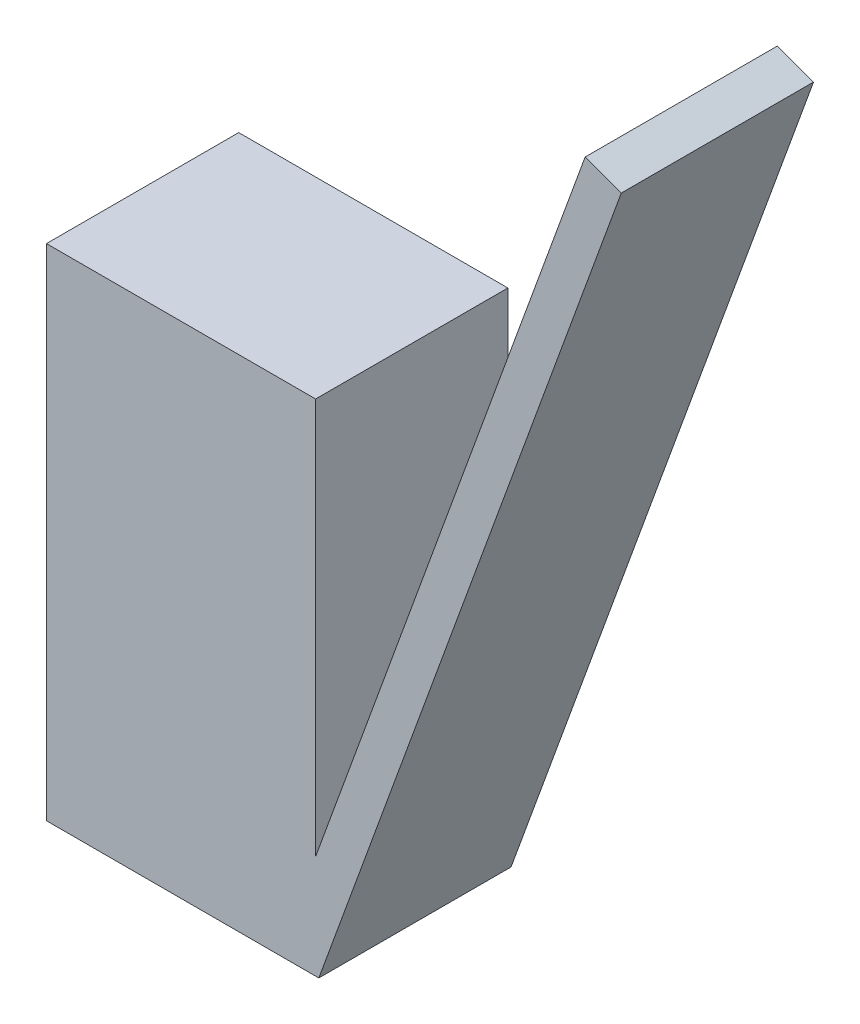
ISO-10303-21;
HEADER;
FILE_DESCRIPTION(('STEP AP214'),'2;1');
FILE_NAME('part.step','',(''),(''),'','','');
FILE_SCHEMA(('AUTOMOTIVE_DESIGN { 1 0 10303 214 1 1 1 1 }'));
ENDSEC;
DATA;
#1=APPLICATION_CONTEXT('core data for automotive mechanical design processes');
#2=APPLICATION_PROTOCOL_DEFINITION('international standard','automotive_design',2000,#1);
#3=PRODUCT_CONTEXT('',#1,'mechanical');
#4=PRODUCT('Part','Part','',(#3));
#5=PRODUCT_RELATED_PRODUCT_CATEGORY('part','',(#4));
#6=PRODUCT_DEFINITION_FORMATION('','',#4);
#7=PRODUCT_DEFINITION_CONTEXT('part definition',#1,'design');
#8=PRODUCT_DEFINITION('design','',#6,#7);
#9=PRODUCT_DEFINITION_SHAPE('','',#8);
#10=(LENGTH_UNIT() NAMED_UNIT(*) SI_UNIT(.MILLI.,.METRE.));
#11=(NAMED_UNIT(*) PLANE_ANGLE_UNIT() SI_UNIT($,.RADIAN.));
#12=(NAMED_UNIT(*) SI_UNIT($,.STERADIAN.) SOLID_ANGLE_UNIT());
#13=UNCERTAINTY_MEASURE_WITH_UNIT(LENGTH_MEASURE(1.E-05),#10,'distance_accuracy_value','');
#14=(GEOMETRIC_REPRESENTATION_CONTEXT(3) GLOBAL_UNCERTAINTY_ASSIGNED_CONTEXT((#13)) GLOBAL_UNIT_ASSIGNED_CONTEXT((#10,
#11,#12)) REPRESENTATION_CONTEXT('',''));
#15=CARTESIAN_POINT('',(0.,0.,0.));
#16=DIRECTION('',(0.,0.,1.));
#17=DIRECTION('',(1.,0.,0.));
#18=AXIS2_PLACEMENT_3D('',#15,#16,#17);
#19=CARTESIAN_POINT('',(-7.0829769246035,13.,5.));
#20=DIRECTION('',(1.,0.,0.));
#21=DIRECTION('',(0.,1.,0.));
#22=AXIS2_PLACEMENT_3D('',#19,#20,#21);
#23=PLANE('',#22);
#24=DIRECTION('',(0.,-1.,0.));
#25=VECTOR('',#24,1.);
#26=CARTESIAN_POINT('',(-7.0829769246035,13.,0.));
#27=LINE('',#26,#25);
#28=CARTESIAN_POINT('',(-7.0829769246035,13.,0.));
#29=VERTEX_POINT('',#28);
#30=CARTESIAN_POINT('',(-7.0829769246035,0.,0.));
#31=VERTEX_POINT('',#30);
#32=EDGE_CURVE('E410',#29,#31,#27,.T.);
#33=ORIENTED_EDGE('',*,*,#32,.T.);
#34=DIRECTION('',(0.,0.,-1.));
#35=VECTOR('',#34,1.);
#36=CARTESIAN_POINT('',(-7.0829769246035,0.,5.));
#37=LINE('',#36,#35);
#38=CARTESIAN_POINT('',(-7.0829769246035,0.,5.));
#39=VERTEX_POINT('',#38);
#40=EDGE_CURVE('E11',#39,#31,#37,.T.);
#41=ORIENTED_EDGE('',*,*,#40,.F.);
#42=DIRECTION('',(0.,-1.,0.));
#43=VECTOR('',#42,1.);
#44=CARTESIAN_POINT('',(-7.0829769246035,13.,5.));
#45=LINE('',#44,#43);
#46=CARTESIAN_POINT('',(-7.0829769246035,13.,5.));
#47=VERTEX_POINT('',#46);
#48=EDGE_CURVE('E435',#47,#39,#45,.T.);
#49=ORIENTED_EDGE('',*,*,#48,.F.);
#50=DIRECTION('',(0.,0.,-1.));
#51=VECTOR('',#50,1.);
#52=CARTESIAN_POINT('',(-7.0829769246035,13.,5.));
#53=LINE('',#52,#51);
#54=EDGE_CURVE('E423',#47,#29,#53,.T.);
#55=ORIENTED_EDGE('',*,*,#54,.T.);
#56=EDGE_LOOP('',(#33,#41,#49,#55));
#57=FACE_BOUND('',#56,.T.);
#58=ADVANCED_FACE('F348',(#57),#23,.F.);
#59=CARTESIAN_POINT('',(-7.0829769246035,0.,5.));
#60=DIRECTION('',(0.,1.,0.));
#61=DIRECTION('',(-1.,0.,0.));
#62=AXIS2_PLACEMENT_3D('',#59,#60,#61);
#63=PLANE('',#62);
#64=DIRECTION('',(1.,0.,0.));
#65=VECTOR('',#64,1.);
#66=CARTESIAN_POINT('',(-7.0829769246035,0.,0.));
#67=LINE('',#66,#65);
#68=CARTESIAN_POINT('',(0.,0.,0.));
#69=VERTEX_POINT('',#68);
#70=EDGE_CURVE('E406',#31,#69,#67,.T.);
#71=ORIENTED_EDGE('',*,*,#70,.T.);
#72=DIRECTION('',(0.,0.,-1.));
#73=VECTOR('',#72,1.);
#74=CARTESIAN_POINT('',(0.,0.,5.));
#75=LINE('',#74,#73);
#76=CARTESIAN_POINT('',(0.,0.,5.));
#77=VERTEX_POINT('',#76);
#78=EDGE_CURVE('E355',#77,#69,#75,.T.);
#79=ORIENTED_EDGE('',*,*,#78,.F.);
#80=DIRECTION('',(1.,0.,0.));
#81=VECTOR('',#80,1.);
#82=CARTESIAN_POINT('',(-7.0829769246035,0.,5.));
#83=LINE('',#82,#81);
#84=EDGE_CURVE('E419',#39,#77,#83,.T.);
#85=ORIENTED_EDGE('',*,*,#84,.F.);
#86=ORIENTED_EDGE('',*,*,#40,.T.);
#87=EDGE_LOOP('',(#71,#79,#85,#86));
#88=FACE_BOUND('',#87,.T.);
#89=ADVANCED_FACE('F418',(#88),#63,.F.);
#90=CARTESIAN_POINT('',(0.,0.,5.));
#91=DIRECTION('',(-0.939692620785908,0.342020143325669,0.));
#92=DIRECTION('',(-0.342020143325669,-0.939692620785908,0.));
#93=AXIS2_PLACEMENT_3D('',#90,#91,#92);
#94=PLANE('',#93);
#95=DIRECTION('',(0.342020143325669,0.939692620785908,0.));
#96=VECTOR('',#95,1.);
#97=CARTESIAN_POINT('',(0.,0.,0.));
#98=LINE('',#97,#96);
#99=CARTESIAN_POINT('',(7.86646329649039,21.6129302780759,0.));
#100=VERTEX_POINT('',#99);
#101=EDGE_CURVE('E412',#69,#100,#98,.T.);
#102=ORIENTED_EDGE('',*,*,#101,.T.);
#103=DIRECTION('',(0.,0.,-1.));
#104=VECTOR('',#103,1.);
#105=CARTESIAN_POINT('',(7.86646329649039,21.6129302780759,5.));
#106=LINE('',#105,#104);
#107=CARTESIAN_POINT('',(7.86646329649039,21.6129302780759,5.));
#108=VERTEX_POINT('',#107);
#109=EDGE_CURVE('E456',#108,#100,#106,.T.);
#110=ORIENTED_EDGE('',*,*,#109,.F.);
#111=DIRECTION('',(0.342020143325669,0.939692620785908,0.));
#112=VECTOR('',#111,1.);
#113=CARTESIAN_POINT('',(0.,0.,5.));
#114=LINE('',#113,#112);
#115=EDGE_CURVE('E438',#77,#108,#114,.T.);
#116=ORIENTED_EDGE('',*,*,#115,.F.);
#117=ORIENTED_EDGE('',*,*,#78,.T.);
#118=EDGE_LOOP('',(#102,#110,#116,#117));
#119=FACE_BOUND('',#118,.T.);
#120=ADVANCED_FACE('F460',(#119),#94,.F.);
#121=CARTESIAN_POINT('',(7.86646329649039,21.6129302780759,5.));
#122=DIRECTION('',(-0.342020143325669,-0.939692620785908,0.));
#123=DIRECTION('',(0.939692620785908,-0.342020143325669,0.));
#124=AXIS2_PLACEMENT_3D('',#121,#122,#123);
#125=PLANE('',#124);
#126=DIRECTION('',(-0.939692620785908,0.342020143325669,0.));
#127=VECTOR('',#126,1.);
#128=CARTESIAN_POINT('',(7.86646329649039,21.6129302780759,0.));
#129=LINE('',#128,#127);
#130=CARTESIAN_POINT('',(6.92677067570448,21.9549504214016,0.));
#131=VERTEX_POINT('',#130);
#132=EDGE_CURVE('E427',#100,#131,#129,.T.);
#133=ORIENTED_EDGE('',*,*,#132,.T.);
#134=DIRECTION('',(0.,0.,-1.));
#135=VECTOR('',#134,1.);
#136=CARTESIAN_POINT('',(6.92677067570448,21.9549504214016,5.));
#137=LINE('',#136,#135);
#138=CARTESIAN_POINT('',(6.92677067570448,21.9549504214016,5.));
#139=VERTEX_POINT('',#138);
#140=EDGE_CURVE('E453',#139,#131,#137,.T.);
#141=ORIENTED_EDGE('',*,*,#140,.F.);
#142=DIRECTION('',(-0.939692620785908,0.342020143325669,0.));
#143=VECTOR('',#142,1.);
#144=CARTESIAN_POINT('',(7.86646329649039,21.6129302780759,5.));
#145=LINE('',#144,#143);
#146=EDGE_CURVE('E440',#108,#139,#145,.T.);
#147=ORIENTED_EDGE('',*,*,#146,.F.);
#148=ORIENTED_EDGE('',*,*,#109,.T.);
#149=EDGE_LOOP('',(#133,#141,#147,#148));
#150=FACE_BOUND('',#149,.T.);
#151=ADVANCED_FACE('F468',(#150),#125,.F.);
#152=CARTESIAN_POINT('',(6.92677067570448,21.9549504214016,5.));
#153=DIRECTION('',(0.939692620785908,-0.34202014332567,0.));
#154=DIRECTION('',(0.34202014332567,0.939692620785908,0.));
#155=AXIS2_PLACEMENT_3D('',#152,#153,#154);
#156=PLANE('',#155);
#157=DIRECTION('',(-0.342020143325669,-0.939692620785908,0.));
#158=VECTOR('',#157,1.);
#159=CARTESIAN_POINT('',(6.92677067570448,21.9549504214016,0.));
#160=LINE('',#159,#158);
#161=CARTESIAN_POINT('',(-0.0829769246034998,2.69582717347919,0.));
#162=VERTEX_POINT('',#161);
#163=EDGE_CURVE('E429',#131,#162,#160,.T.);
#164=ORIENTED_EDGE('',*,*,#163,.T.);
#165=DIRECTION('',(0.,0.,-1.));
#166=VECTOR('',#165,1.);
#167=CARTESIAN_POINT('',(-0.0829769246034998,2.69582717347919,5.));
#168=LINE('',#167,#166);
#169=CARTESIAN_POINT('',(-0.0829769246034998,2.69582717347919,5.));
#170=VERTEX_POINT('',#169);
#171=EDGE_CURVE('E450',#170,#162,#168,.T.);
#172=ORIENTED_EDGE('',*,*,#171,.F.);
#173=DIRECTION('',(-0.342020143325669,-0.939692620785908,0.));
#174=VECTOR('',#173,1.);
#175=CARTESIAN_POINT('',(6.92677067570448,21.9549504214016,5.));
#176=LINE('',#175,#174);
#177=EDGE_CURVE('E442',#139,#170,#176,.T.);
#178=ORIENTED_EDGE('',*,*,#177,.F.);
#179=ORIENTED_EDGE('',*,*,#140,.T.);
#180=EDGE_LOOP('',(#164,#172,#178,#179));
#181=FACE_BOUND('',#180,.T.);
#182=ADVANCED_FACE('F471',(#181),#156,.F.);
#183=CARTESIAN_POINT('',(-0.0829769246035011,13.,5.));
#184=DIRECTION('',(-1.,0.,0.));
#185=DIRECTION('',(0.,-1.,0.));
#186=AXIS2_PLACEMENT_3D('',#183,#184,#185);
#187=PLANE('',#186);
#188=DIRECTION('',(0.,1.,0.));
#189=VECTOR('',#188,1.);
#190=CARTESIAN_POINT('',(-0.0829769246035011,13.,0.));
#191=LINE('',#190,#189);
#192=CARTESIAN_POINT('',(-0.0829769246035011,13.,0.));
#193=VERTEX_POINT('',#192);
#194=EDGE_CURVE('E431',#162,#193,#191,.T.);
#195=ORIENTED_EDGE('',*,*,#194,.T.);
#196=DIRECTION('',(0.,0.,-1.));
#197=VECTOR('',#196,1.);
#198=CARTESIAN_POINT('',(-0.0829769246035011,13.,5.));
#199=LINE('',#198,#197);
#200=CARTESIAN_POINT('',(-0.0829769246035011,13.,5.));
#201=VERTEX_POINT('',#200);
#202=EDGE_CURVE('E447',#201,#193,#199,.T.);
#203=ORIENTED_EDGE('',*,*,#202,.F.);
#204=DIRECTION('',(0.,1.,0.));
#205=VECTOR('',#204,1.);
#206=CARTESIAN_POINT('',(-0.0829769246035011,13.,5.));
#207=LINE('',#206,#205);
#208=EDGE_CURVE('E367',#170,#201,#207,.T.);
#209=ORIENTED_EDGE('',*,*,#208,.F.);
#210=ORIENTED_EDGE('',*,*,#171,.T.);
#211=EDGE_LOOP('',(#195,#203,#209,#210));
#212=FACE_BOUND('',#211,.T.);
#213=ADVANCED_FACE('F474',(#212),#187,.F.);
#214=CARTESIAN_POINT('',(-7.0829769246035,13.,5.));
#215=DIRECTION('',(0.,-1.,0.));
#216=DIRECTION('',(0.,0.,-1.));
#217=AXIS2_PLACEMENT_3D('',#214,#215,#216);
#218=PLANE('',#217);
#219=DIRECTION('',(-1.,0.,0.));
#220=VECTOR('',#219,1.);
#221=CARTESIAN_POINT('',(-7.0829769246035,13.,0.));
#222=LINE('',#221,#220);
#223=EDGE_CURVE('E433',#193,#29,#222,.T.);
#224=ORIENTED_EDGE('',*,*,#223,.T.);
#225=ORIENTED_EDGE('',*,*,#54,.F.);
#226=DIRECTION('',(-1.,0.,0.));
#227=VECTOR('',#226,1.);
#228=CARTESIAN_POINT('',(-7.0829769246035,13.,5.));
#229=LINE('',#228,#227);
#230=EDGE_CURVE('E362',#201,#47,#229,.T.);
#231=ORIENTED_EDGE('',*,*,#230,.F.);
#232=ORIENTED_EDGE('',*,*,#202,.T.);
#233=EDGE_LOOP('',(#224,#225,#231,#232));
#234=FACE_BOUND('',#233,.T.);
#235=ADVANCED_FACE('F476',(#234),#218,.F.);
#236=CARTESIAN_POINT('',(-7.0829769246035,0.,5.));
#237=DIRECTION('',(0.,0.,1.));
#238=DIRECTION('',(1.,0.,0.));
#239=AXIS2_PLACEMENT_3D('',#236,#237,#238);
#240=PLANE('',#239);
#241=ORIENTED_EDGE('',*,*,#48,.T.);
#242=ORIENTED_EDGE('',*,*,#84,.T.);
#243=ORIENTED_EDGE('',*,*,#115,.T.);
#244=ORIENTED_EDGE('',*,*,#146,.T.);
#245=ORIENTED_EDGE('',*,*,#177,.T.);
#246=ORIENTED_EDGE('',*,*,#208,.T.);
#247=ORIENTED_EDGE('',*,*,#230,.T.);
#248=EDGE_LOOP('',(#241,#242,#243,#244,#245,#246,#247));
#249=FACE_BOUND('',#248,.T.);
#250=ADVANCED_FACE('F463',(#249),#240,.T.);
#251=CARTESIAN_POINT('',(-7.0829769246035,0.,0.));
#252=DIRECTION('',(0.,0.,1.));
#253=DIRECTION('',(1.,0.,0.));
#254=AXIS2_PLACEMENT_3D('',#251,#252,#253);
#255=PLANE('',#254);
#256=ORIENTED_EDGE('',*,*,#32,.F.);
#257=ORIENTED_EDGE('',*,*,#223,.F.);
#258=ORIENTED_EDGE('',*,*,#194,.F.);
#259=ORIENTED_EDGE('',*,*,#163,.F.);
#260=ORIENTED_EDGE('',*,*,#132,.F.);
#261=ORIENTED_EDGE('',*,*,#101,.F.);
#262=ORIENTED_EDGE('',*,*,#70,.F.);
#263=EDGE_LOOP('',(#256,#257,#258,#259,#260,#261,#262));
#264=FACE_BOUND('',#263,.T.);
#265=ADVANCED_FACE('F407',(#264),#255,.F.);
#266=CLOSED_SHELL('',(#58,#89,#120,#151,#182,#213,#235,#250,#265));
#267=MANIFOLD_SOLID_BREP('B2',#266);
#268=ADVANCED_BREP_SHAPE_REPRESENTATION('',(#18,#267),#14);
#269=SHAPE_DEFINITION_REPRESENTATION(#9,#268);
ENDSEC;
END-ISO-10303-21;
